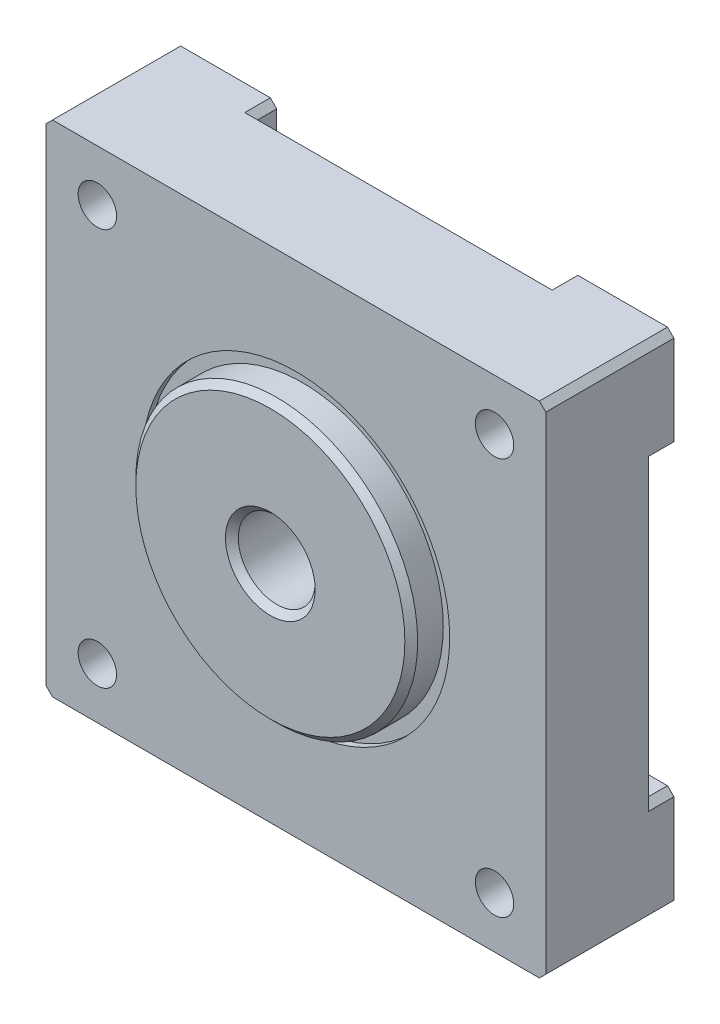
from build123d import *

# Parameters (mm, degrees)
EXTRUDE_1_DEPTH     = 10
SKETCH_3_R          = 11
EXTRUDE_2_DEPTH     = 2
CUT_EXTRUDE_START   = -0.5
SKETCH_4_R          = 12
SKETCH_4_R_2        = 11
CUT_EXTRUDE_1_DEPTH = 0.5
SKETCH_5_R          = 2.75
CUT_EXTRUDE_2_DEPTH = 31.074906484
SKETCH_6_R          = 1.5
CUT_EXTRUDE_3_DEPTH = 30.334280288
CUT_EXTRUDE_START_2 = -2
SKETCH_7_R          = 2.75
CUT_EXTRUDE_4_DEPTH = 2
CHAMFER_1_SIZE      = 0.5
SKETCH_8_R          = 3
CUT_EXTRUDE_5_DEPTH = 31.074906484
CHAMFER_2_SIZE      = 0.5
CHAMFER_3_SIZE      = 0.5


with BuildPart() as part:
    # Sketch 2 → Extrude 1 (new body)
    with BuildSketch(Plane.XY):
        Polygon((-19, 19.5), (-19.5, 19), (-19.5, -19), (-19, -19.5), (19, -19.5), (19.5, -19), (19.5, 19), (19, 19.5), align=None)
    extrude(amount=EXTRUDE_1_DEPTH)

    # Sketch 3 → Extrude 2 (add)
    with BuildSketch(Plane.XY.offset(10)):
        Circle(SKETCH_3_R)
    extrude(amount=EXTRUDE_2_DEPTH)

    # Sketch 4 → Cut-Extrude 1 (cut)
    with BuildSketch(Plane.XY.offset(10).offset(CUT_EXTRUDE_START)):
        Circle(SKETCH_4_R)
        Circle(SKETCH_4_R_2, mode=Mode.SUBTRACT)
    extrude(amount=CUT_EXTRUDE_1_DEPTH, mode=Mode.SUBTRACT)

    # Sketch 5 → Cut-Extrude 2 (cut, through all)
    with BuildSketch(Plane.XY.offset(12)):
        Circle(SKETCH_5_R)
    extrude(amount=-CUT_EXTRUDE_2_DEPTH, mode=Mode.SUBTRACT)

    # Sketch 6 → Cut-Extrude 3 (cut, through all)
    with BuildSketch(Plane.XY.offset(10)):
        with Locations((-15.5, 15.5)):
            Circle(SKETCH_6_R)
        with Locations(Location((15.5, 15.5, 0), (0, 0, 180))):
            Circle(SKETCH_6_R)
        with Locations((15.5, -15.5)):
            Circle(SKETCH_6_R)
        with Locations(Location((-15.5, -15.5, 0), (0, 0, 180))):
            Circle(SKETCH_6_R)
    extrude(amount=-CUT_EXTRUDE_3_DEPTH, mode=Mode.SUBTRACT)

    # Sketch 7 → Cut-Extrude 4 (cut)
    with BuildSketch(Plane(origin=(0, 0, 0), x_dir=(-1, 0, 0), z_dir=(0, 0, -1)).offset(CUT_EXTRUDE_START_2)):
        Polygon((-11.5, 19.5), (-11.5, 11.5), (-19.5, 11.5), (-19.5, -11.5), (-11.5, -11.5), (-11.5, -19.5), (11.5, -19.5), (11.5, -11.5), (19.5, -11.5), (19.5, 11.5), (11.5, 11.5), (11.5, 19.5), align=None)
        with Locations(Location((0, 0, 0), (0, 0, 180))):
            Circle(SKETCH_7_R, mode=Mode.SUBTRACT)
    extrude(amount=CUT_EXTRUDE_4_DEPTH, mode=Mode.SUBTRACT)

    # Chamfer 1
    chamfer_1_edges = [part.edges().sort_by_distance(p)[0] for p in [
        (11.5, -11.5, 1),
        (19.5, -11.5, 1),
        (19.5, 11.5, 1),
        (11.5, 11.5, 1),
        (11.5, 19.5, 1),
        (-11.5, 19.5, 1),
        (-11.5, 11.5, 1),
        (-19.5, 11.5, 1),
        (-19.5, -11.5, 1),
        (-11.5, -11.5, 1),
        (-11.5, -19.5, 1),
        (11.5, -19.5, 1),
    ]]
    chamfer(chamfer_1_edges, length=CHAMFER_1_SIZE)

    # Sketch 8 → Cut-Extrude 5 (cut, through all)
    with BuildSketch(Plane.XY.offset(12)):
        Circle(SKETCH_8_R)
    extrude(amount=-CUT_EXTRUDE_5_DEPTH, mode=Mode.SUBTRACT)

    # Chamfer 2
    chamfer_2_edges = [part.edges().sort_by_distance(p)[0] for p in [
        (-3, 0, 12),
        (-3, 0, 2),
    ]]
    chamfer(chamfer_2_edges, length=CHAMFER_2_SIZE)

    # Chamfer 3
    chamfer_3_edges = [part.edges().sort_by_distance(p)[0] for p in [
        (-11, 0, 12),
    ]]
    chamfer(chamfer_3_edges, length=CHAMFER_3_SIZE)


solid = part.part
